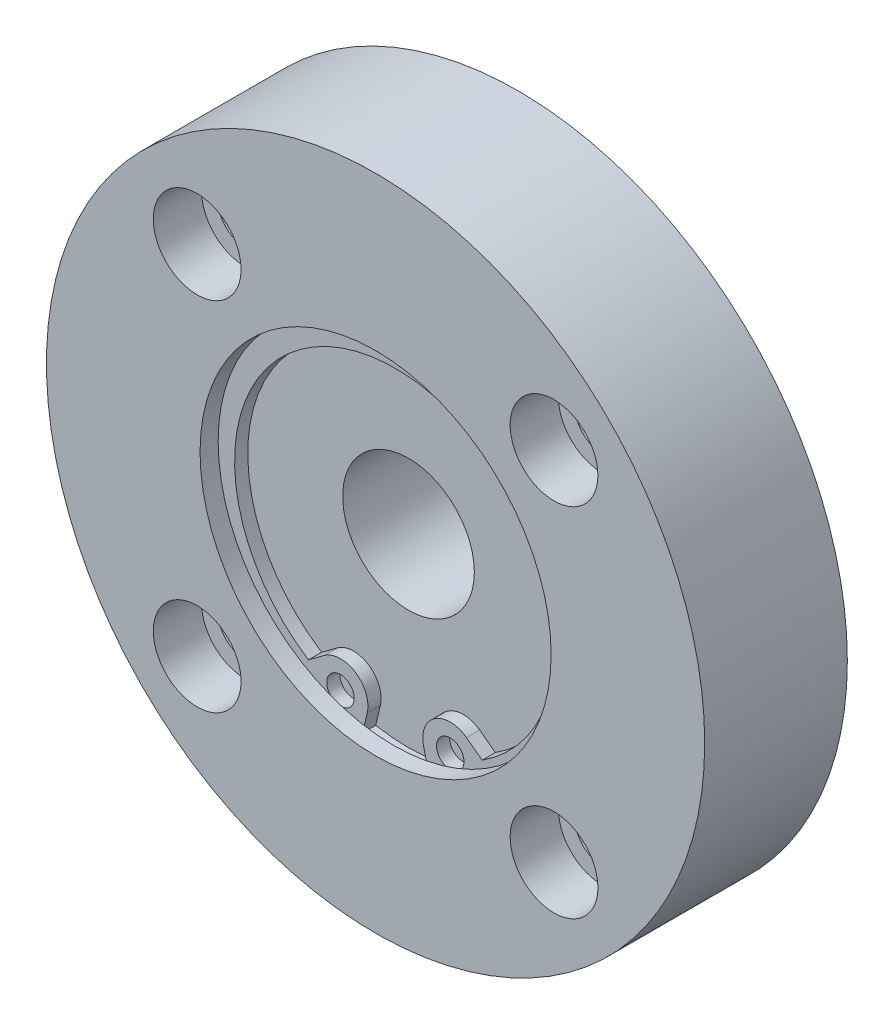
ISO-10303-21;
HEADER;
FILE_DESCRIPTION(('STEP AP214'),'2;1');
FILE_NAME('part.step','',(''),(''),'','','');
FILE_SCHEMA(('AUTOMOTIVE_DESIGN { 1 0 10303 214 1 1 1 1 }'));
ENDSEC;
DATA;
#1=APPLICATION_CONTEXT('core data for automotive mechanical design processes');
#2=APPLICATION_PROTOCOL_DEFINITION('international standard','automotive_design',2000,#1);
#3=PRODUCT_CONTEXT('',#1,'mechanical');
#4=PRODUCT('Part','Part','',(#3));
#5=PRODUCT_RELATED_PRODUCT_CATEGORY('part','',(#4));
#6=PRODUCT_DEFINITION_FORMATION('','',#4);
#7=PRODUCT_DEFINITION_CONTEXT('part definition',#1,'design');
#8=PRODUCT_DEFINITION('design','',#6,#7);
#9=PRODUCT_DEFINITION_SHAPE('','',#8);
#10=(LENGTH_UNIT() NAMED_UNIT(*) SI_UNIT(.MILLI.,.METRE.));
#11=(NAMED_UNIT(*) PLANE_ANGLE_UNIT() SI_UNIT($,.RADIAN.));
#12=(NAMED_UNIT(*) SI_UNIT($,.STERADIAN.) SOLID_ANGLE_UNIT());
#13=UNCERTAINTY_MEASURE_WITH_UNIT(LENGTH_MEASURE(1.E-05),#10,'distance_accuracy_value','');
#14=(GEOMETRIC_REPRESENTATION_CONTEXT(3) GLOBAL_UNCERTAINTY_ASSIGNED_CONTEXT((#13)) GLOBAL_UNIT_ASSIGNED_CONTEXT((#10,
#11,#12)) REPRESENTATION_CONTEXT('',''));
#15=CARTESIAN_POINT('',(0.,0.,0.));
#16=DIRECTION('',(0.,0.,1.));
#17=DIRECTION('',(1.,0.,0.));
#18=AXIS2_PLACEMENT_3D('',#15,#16,#17);
#19=CARTESIAN_POINT('',(0.,0.,10.));
#20=DIRECTION('',(0.,0.,1.));
#21=DIRECTION('',(1.,0.,0.));
#22=AXIS2_PLACEMENT_3D('',#19,#20,#21);
#23=PLANE('',#22);
#24=CARTESIAN_POINT('',(5.,-14.2233767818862,10.));
#25=DIRECTION('',(0.,0.,1.));
#26=DIRECTION('',(1.,0.,0.));
#27=AXIS2_PLACEMENT_3D('',#24,#25,#26);
#28=CIRCLE('',#27,1.25);
#29=CARTESIAN_POINT('',(6.25,-14.2233767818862,10.));
#30=VERTEX_POINT('',#29);
#31=EDGE_CURVE('E117',#30,#30,#28,.T.);
#32=ORIENTED_EDGE('',*,*,#31,.T.);
#33=EDGE_LOOP('',(#32));
#34=FACE_BOUND('',#33,.T.);
#35=ADVANCED_FACE('F14',(#34),#23,.T.);
#36=CARTESIAN_POINT('',(-5.,-14.2233767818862,10.));
#37=DIRECTION('',(0.,0.,-1.));
#38=DIRECTION('',(1.,0.,0.));
#39=AXIS2_PLACEMENT_3D('',#36,#37,#38);
#40=CIRCLE('',#39,1.25);
#41=CARTESIAN_POINT('',(-3.75,-14.2233767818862,10.));
#42=VERTEX_POINT('',#41);
#43=EDGE_CURVE('E143',#42,#42,#40,.T.);
#44=ORIENTED_EDGE('',*,*,#43,.F.);
#45=EDGE_LOOP('',(#44));
#46=FACE_BOUND('',#45,.T.);
#47=ADVANCED_FACE('F286',(#46),#23,.T.);
#48=CARTESIAN_POINT('',(16.2634559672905,16.2634559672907,0.));
#49=DIRECTION('',(0.,0.,1.));
#50=DIRECTION('',(1.,0.,0.));
#51=AXIS2_PLACEMENT_3D('',#48,#49,#50);
#52=CYLINDRICAL_SURFACE('',#51,2.5);
#53=CARTESIAN_POINT('',(16.2634559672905,16.2634559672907,0.));
#54=DIRECTION('',(0.,0.,1.));
#55=DIRECTION('',(1.,0.,0.));
#56=AXIS2_PLACEMENT_3D('',#53,#54,#55);
#57=CIRCLE('',#56,2.5);
#58=CARTESIAN_POINT('',(18.7634559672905,16.2634559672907,0.));
#59=VERTEX_POINT('',#58);
#60=EDGE_CURVE('E239',#59,#59,#57,.T.);
#61=ORIENTED_EDGE('',*,*,#60,.F.);
#62=EDGE_LOOP('',(#61));
#63=FACE_BOUND('',#62,.T.);
#64=CARTESIAN_POINT('',(16.2634559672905,16.2634559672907,8.6));
#65=DIRECTION('',(0.,0.,1.));
#66=DIRECTION('',(1.,0.,0.));
#67=AXIS2_PLACEMENT_3D('',#64,#65,#66);
#68=CIRCLE('',#67,2.5);
#69=CARTESIAN_POINT('',(18.7634559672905,16.2634559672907,8.6));
#70=VERTEX_POINT('',#69);
#71=EDGE_CURVE('E238',#70,#70,#68,.F.);
#72=ORIENTED_EDGE('',*,*,#71,.F.);
#73=EDGE_LOOP('',(#72));
#74=FACE_BOUND('',#73,.T.);
#75=ADVANCED_FACE('F294',(#63,#74),#52,.F.);
#76=CARTESIAN_POINT('',(16.2634559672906,-16.2634559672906,0.));
#77=DIRECTION('',(0.,0.,1.));
#78=DIRECTION('',(1.,0.,0.));
#79=AXIS2_PLACEMENT_3D('',#76,#77,#78);
#80=CYLINDRICAL_SURFACE('',#79,2.5);
#81=CARTESIAN_POINT('',(16.2634559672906,-16.2634559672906,0.));
#82=DIRECTION('',(0.,0.,1.));
#83=DIRECTION('',(0.,-1.,0.));
#84=AXIS2_PLACEMENT_3D('',#81,#82,#83);
#85=CIRCLE('',#84,2.5);
#86=CARTESIAN_POINT('',(16.2634559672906,-18.7634559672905,0.));
#87=VERTEX_POINT('',#86);
#88=EDGE_CURVE('E229',#87,#87,#85,.T.);
#89=ORIENTED_EDGE('',*,*,#88,.F.);
#90=EDGE_LOOP('',(#89));
#91=FACE_BOUND('',#90,.T.);
#92=CARTESIAN_POINT('',(16.2634559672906,-16.2634559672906,8.6));
#93=DIRECTION('',(0.,0.,1.));
#94=DIRECTION('',(1.,0.,0.));
#95=AXIS2_PLACEMENT_3D('',#92,#93,#94);
#96=CIRCLE('',#95,2.5);
#97=CARTESIAN_POINT('',(18.7634559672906,-16.2634559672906,8.6));
#98=VERTEX_POINT('',#97);
#99=EDGE_CURVE('E222',#98,#98,#96,.F.);
#100=ORIENTED_EDGE('',*,*,#99,.F.);
#101=EDGE_LOOP('',(#100));
#102=FACE_BOUND('',#101,.T.);
#103=ADVANCED_FACE('F608',(#91,#102),#80,.F.);
#104=CARTESIAN_POINT('',(-16.2634559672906,-16.2634559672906,0.));
#105=DIRECTION('',(0.,0.,1.));
#106=DIRECTION('',(1.,0.,0.));
#107=AXIS2_PLACEMENT_3D('',#104,#105,#106);
#108=CYLINDRICAL_SURFACE('',#107,2.5);
#109=CARTESIAN_POINT('',(-16.2634559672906,-16.2634559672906,0.));
#110=DIRECTION('',(0.,0.,1.));
#111=DIRECTION('',(-1.,0.,0.));
#112=AXIS2_PLACEMENT_3D('',#109,#110,#111);
#113=CIRCLE('',#112,2.5);
#114=CARTESIAN_POINT('',(-18.7634559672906,-16.2634559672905,0.));
#115=VERTEX_POINT('',#114);
#116=EDGE_CURVE('E226',#115,#115,#113,.T.);
#117=ORIENTED_EDGE('',*,*,#116,.F.);
#118=EDGE_LOOP('',(#117));
#119=FACE_BOUND('',#118,.T.);
#120=CARTESIAN_POINT('',(-16.2634559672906,-16.2634559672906,8.6));
#121=DIRECTION('',(0.,0.,1.));
#122=DIRECTION('',(1.,0.,0.));
#123=AXIS2_PLACEMENT_3D('',#120,#121,#122);
#124=CIRCLE('',#123,2.5);
#125=CARTESIAN_POINT('',(-13.7634559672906,-16.2634559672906,8.6));
#126=VERTEX_POINT('',#125);
#127=EDGE_CURVE('E215',#126,#126,#124,.F.);
#128=ORIENTED_EDGE('',*,*,#127,.F.);
#129=EDGE_LOOP('',(#128));
#130=FACE_BOUND('',#129,.T.);
#131=ADVANCED_FACE('F598',(#119,#130),#108,.F.);
#132=CARTESIAN_POINT('',(-16.2634559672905,16.2634559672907,0.));
#133=DIRECTION('',(0.,0.,1.));
#134=DIRECTION('',(1.,0.,0.));
#135=AXIS2_PLACEMENT_3D('',#132,#133,#134);
#136=CYLINDRICAL_SURFACE('',#135,2.5);
#137=CARTESIAN_POINT('',(-16.2634559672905,16.2634559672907,0.));
#138=DIRECTION('',(0.,0.,1.));
#139=DIRECTION('',(0.,1.,0.));
#140=AXIS2_PLACEMENT_3D('',#137,#138,#139);
#141=CIRCLE('',#140,2.5);
#142=CARTESIAN_POINT('',(-16.2634559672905,18.7634559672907,0.));
#143=VERTEX_POINT('',#142);
#144=EDGE_CURVE('E223',#143,#143,#141,.T.);
#145=ORIENTED_EDGE('',*,*,#144,.F.);
#146=EDGE_LOOP('',(#145));
#147=FACE_BOUND('',#146,.T.);
#148=CARTESIAN_POINT('',(-16.2634559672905,16.2634559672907,8.6));
#149=DIRECTION('',(0.,0.,1.));
#150=DIRECTION('',(1.,0.,0.));
#151=AXIS2_PLACEMENT_3D('',#148,#149,#150);
#152=CIRCLE('',#151,2.5);
#153=CARTESIAN_POINT('',(-13.7634559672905,16.2634559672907,8.6));
#154=VERTEX_POINT('',#153);
#155=EDGE_CURVE('E208',#154,#154,#152,.F.);
#156=ORIENTED_EDGE('',*,*,#155,.F.);
#157=EDGE_LOOP('',(#156));
#158=FACE_BOUND('',#157,.T.);
#159=ADVANCED_FACE('F589',(#147,#158),#136,.F.);
#160=CARTESIAN_POINT('',(0.,0.,0.));
#161=DIRECTION('',(0.,0.,1.));
#162=DIRECTION('',(1.,0.,0.));
#163=AXIS2_PLACEMENT_3D('',#160,#161,#162);
#164=PLANE('',#163);
#165=ORIENTED_EDGE('',*,*,#144,.T.);
#166=EDGE_LOOP('',(#165));
#167=FACE_BOUND('',#166,.T.);
#168=ORIENTED_EDGE('',*,*,#116,.T.);
#169=EDGE_LOOP('',(#168));
#170=FACE_BOUND('',#169,.T.);
#171=ORIENTED_EDGE('',*,*,#88,.T.);
#172=EDGE_LOOP('',(#171));
#173=FACE_BOUND('',#172,.T.);
#174=ORIENTED_EDGE('',*,*,#60,.T.);
#175=EDGE_LOOP('',(#174));
#176=FACE_BOUND('',#175,.T.);
#177=CARTESIAN_POINT('',(0.,0.,0.));
#178=DIRECTION('',(0.,0.,1.));
#179=DIRECTION('',(1.,0.,0.));
#180=AXIS2_PLACEMENT_3D('',#177,#178,#179);
#181=CIRCLE('',#180,30.);
#182=CARTESIAN_POINT('',(30.,0.,0.));
#183=VERTEX_POINT('',#182);
#184=EDGE_CURVE('E245',#183,#183,#181,.T.);
#185=ORIENTED_EDGE('',*,*,#184,.F.);
#186=EDGE_LOOP('',(#185));
#187=FACE_BOUND('',#186,.T.);
#188=CARTESIAN_POINT('',(0.,0.,0.));
#189=DIRECTION('',(0.,0.,-1.));
#190=DIRECTION('',(-1.,0.,0.));
#191=AXIS2_PLACEMENT_3D('',#188,#189,#190);
#192=CIRCLE('',#191,19.);
#193=CARTESIAN_POINT('',(-19.,0.,0.));
#194=VERTEX_POINT('',#193);
#195=EDGE_CURVE('E144',#194,#194,#192,.T.);
#196=ORIENTED_EDGE('',*,*,#195,.F.);
#197=EDGE_LOOP('',(#196));
#198=FACE_BOUND('',#197,.T.);
#199=ADVANCED_FACE('F282',(#167,#170,#173,#176,#187,#198),#164,.F.);
#200=CARTESIAN_POINT('',(16.2634559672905,16.2634559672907,8.6));
#201=DIRECTION('',(0.,0.,1.));
#202=DIRECTION('',(1.,0.,0.));
#203=AXIS2_PLACEMENT_3D('',#200,#201,#202);
#204=PLANE('',#203);
#205=CARTESIAN_POINT('',(16.2634559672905,16.2634559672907,8.6));
#206=DIRECTION('',(0.,0.,1.));
#207=DIRECTION('',(1.,0.,0.));
#208=AXIS2_PLACEMENT_3D('',#205,#206,#207);
#209=CIRCLE('',#208,4.);
#210=CARTESIAN_POINT('',(20.2634559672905,16.2634559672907,8.6));
#211=VERTEX_POINT('',#210);
#212=EDGE_CURVE('E235',#211,#211,#209,.T.);
#213=ORIENTED_EDGE('',*,*,#212,.T.);
#214=EDGE_LOOP('',(#213));
#215=FACE_BOUND('',#214,.T.);
#216=ORIENTED_EDGE('',*,*,#71,.T.);
#217=EDGE_LOOP('',(#216));
#218=FACE_BOUND('',#217,.T.);
#219=ADVANCED_FACE('F570',(#215,#218),#204,.T.);
#220=CARTESIAN_POINT('',(16.2634559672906,-16.2634559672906,8.6));
#221=DIRECTION('',(0.,0.,1.));
#222=DIRECTION('',(0.,-1.,0.));
#223=AXIS2_PLACEMENT_3D('',#220,#221,#222);
#224=PLANE('',#223);
#225=CARTESIAN_POINT('',(16.2634559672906,-16.2634559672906,8.6));
#226=DIRECTION('',(0.,0.,1.));
#227=DIRECTION('',(0.,-1.,0.));
#228=AXIS2_PLACEMENT_3D('',#225,#226,#227);
#229=CIRCLE('',#228,4.);
#230=CARTESIAN_POINT('',(16.2634559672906,-20.2634559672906,8.6));
#231=VERTEX_POINT('',#230);
#232=EDGE_CURVE('E219',#231,#231,#229,.T.);
#233=ORIENTED_EDGE('',*,*,#232,.T.);
#234=EDGE_LOOP('',(#233));
#235=FACE_BOUND('',#234,.T.);
#236=ORIENTED_EDGE('',*,*,#99,.T.);
#237=EDGE_LOOP('',(#236));
#238=FACE_BOUND('',#237,.T.);
#239=ADVANCED_FACE('F560',(#235,#238),#224,.T.);
#240=CARTESIAN_POINT('',(-16.2634559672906,-16.2634559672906,8.6));
#241=DIRECTION('',(0.,0.,1.));
#242=DIRECTION('',(-1.,0.,0.));
#243=AXIS2_PLACEMENT_3D('',#240,#241,#242);
#244=PLANE('',#243);
#245=CARTESIAN_POINT('',(-16.2634559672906,-16.2634559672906,8.6));
#246=DIRECTION('',(0.,0.,1.));
#247=DIRECTION('',(-1.,0.,0.));
#248=AXIS2_PLACEMENT_3D('',#245,#246,#247);
#249=CIRCLE('',#248,4.);
#250=CARTESIAN_POINT('',(-20.2634559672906,-16.2634559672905,8.6));
#251=VERTEX_POINT('',#250);
#252=EDGE_CURVE('E212',#251,#251,#249,.T.);
#253=ORIENTED_EDGE('',*,*,#252,.T.);
#254=EDGE_LOOP('',(#253));
#255=FACE_BOUND('',#254,.T.);
#256=ORIENTED_EDGE('',*,*,#127,.T.);
#257=EDGE_LOOP('',(#256));
#258=FACE_BOUND('',#257,.T.);
#259=ADVANCED_FACE('F550',(#255,#258),#244,.T.);
#260=CARTESIAN_POINT('',(-16.2634559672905,16.2634559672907,8.6));
#261=DIRECTION('',(0.,0.,1.));
#262=DIRECTION('',(0.,1.,0.));
#263=AXIS2_PLACEMENT_3D('',#260,#261,#262);
#264=PLANE('',#263);
#265=CARTESIAN_POINT('',(-16.2634559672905,16.2634559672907,8.6));
#266=DIRECTION('',(0.,0.,1.));
#267=DIRECTION('',(0.,1.,0.));
#268=AXIS2_PLACEMENT_3D('',#265,#266,#267);
#269=CIRCLE('',#268,4.);
#270=CARTESIAN_POINT('',(-16.2634559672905,20.2634559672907,8.6));
#271=VERTEX_POINT('',#270);
#272=EDGE_CURVE('E205',#271,#271,#269,.T.);
#273=ORIENTED_EDGE('',*,*,#272,.T.);
#274=EDGE_LOOP('',(#273));
#275=FACE_BOUND('',#274,.T.);
#276=ORIENTED_EDGE('',*,*,#155,.T.);
#277=EDGE_LOOP('',(#276));
#278=FACE_BOUND('',#277,.T.);
#279=ADVANCED_FACE('F541',(#275,#278),#264,.T.);
#280=CARTESIAN_POINT('',(0.,0.,-5.));
#281=DIRECTION('',(0.,0.,1.));
#282=DIRECTION('',(1.,0.,0.));
#283=AXIS2_PLACEMENT_3D('',#280,#281,#282);
#284=CYLINDRICAL_SURFACE('',#283,19.);
#285=CARTESIAN_POINT('',(0.,0.,-5.));
#286=DIRECTION('',(0.,0.,-1.));
#287=DIRECTION('',(-1.,0.,0.));
#288=AXIS2_PLACEMENT_3D('',#285,#286,#287);
#289=CIRCLE('',#288,19.);
#290=CARTESIAN_POINT('',(-19.,0.,-5.));
#291=VERTEX_POINT('',#290);
#292=EDGE_CURVE('E192',#291,#291,#289,.T.);
#293=ORIENTED_EDGE('',*,*,#292,.F.);
#294=EDGE_LOOP('',(#293));
#295=FACE_BOUND('',#294,.T.);
#296=ORIENTED_EDGE('',*,*,#195,.T.);
#297=EDGE_LOOP('',(#296));
#298=FACE_BOUND('',#297,.T.);
#299=ADVANCED_FACE('F532',(#295,#298),#284,.T.);
#300=CARTESIAN_POINT('',(0.,0.,13.));
#301=DIRECTION('',(0.,0.,-1.));
#302=DIRECTION('',(-1.,0.,0.));
#303=AXIS2_PLACEMENT_3D('',#300,#301,#302);
#304=CYLINDRICAL_SURFACE('',#303,30.);
#305=CARTESIAN_POINT('',(0.,0.,13.));
#306=DIRECTION('',(0.,0.,1.));
#307=DIRECTION('',(1.,0.,0.));
#308=AXIS2_PLACEMENT_3D('',#305,#306,#307);
#309=CIRCLE('',#308,30.);
#310=CARTESIAN_POINT('',(30.,0.,13.));
#311=VERTEX_POINT('',#310);
#312=EDGE_CURVE('E195',#311,#311,#309,.T.);
#313=ORIENTED_EDGE('',*,*,#312,.F.);
#314=EDGE_LOOP('',(#313));
#315=FACE_BOUND('',#314,.T.);
#316=ORIENTED_EDGE('',*,*,#184,.T.);
#317=EDGE_LOOP('',(#316));
#318=FACE_BOUND('',#317,.T.);
#319=ADVANCED_FACE('F16',(#315,#318),#304,.T.);
#320=CARTESIAN_POINT('',(16.2634559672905,16.2634559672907,8.6));
#321=DIRECTION('',(0.,0.,1.));
#322=DIRECTION('',(1.,0.,0.));
#323=AXIS2_PLACEMENT_3D('',#320,#321,#322);
#324=CYLINDRICAL_SURFACE('',#323,4.);
#325=ORIENTED_EDGE('',*,*,#212,.F.);
#326=EDGE_LOOP('',(#325));
#327=FACE_BOUND('',#326,.T.);
#328=CARTESIAN_POINT('',(16.2634559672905,16.2634559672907,13.));
#329=DIRECTION('',(0.,0.,1.));
#330=DIRECTION('',(1.,0.,0.));
#331=AXIS2_PLACEMENT_3D('',#328,#329,#330);
#332=CIRCLE('',#331,4.);
#333=CARTESIAN_POINT('',(20.2634559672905,16.2634559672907,13.));
#334=VERTEX_POINT('',#333);
#335=EDGE_CURVE('E232',#334,#334,#332,.T.);
#336=ORIENTED_EDGE('',*,*,#335,.T.);
#337=EDGE_LOOP('',(#336));
#338=FACE_BOUND('',#337,.T.);
#339=ADVANCED_FACE('F513',(#327,#338),#324,.F.);
#340=CARTESIAN_POINT('',(16.2634559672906,-16.2634559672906,8.6));
#341=DIRECTION('',(0.,0.,1.));
#342=DIRECTION('',(1.,0.,0.));
#343=AXIS2_PLACEMENT_3D('',#340,#341,#342);
#344=CYLINDRICAL_SURFACE('',#343,4.);
#345=ORIENTED_EDGE('',*,*,#232,.F.);
#346=EDGE_LOOP('',(#345));
#347=FACE_BOUND('',#346,.T.);
#348=CARTESIAN_POINT('',(16.2634559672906,-16.2634559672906,13.));
#349=DIRECTION('',(0.,0.,1.));
#350=DIRECTION('',(0.,-1.,0.));
#351=AXIS2_PLACEMENT_3D('',#348,#349,#350);
#352=CIRCLE('',#351,4.);
#353=CARTESIAN_POINT('',(16.2634559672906,-20.2634559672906,13.));
#354=VERTEX_POINT('',#353);
#355=EDGE_CURVE('E216',#354,#354,#352,.T.);
#356=ORIENTED_EDGE('',*,*,#355,.T.);
#357=EDGE_LOOP('',(#356));
#358=FACE_BOUND('',#357,.T.);
#359=ADVANCED_FACE('F503',(#347,#358),#344,.F.);
#360=CARTESIAN_POINT('',(-16.2634559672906,-16.2634559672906,8.6));
#361=DIRECTION('',(0.,0.,1.));
#362=DIRECTION('',(1.,0.,0.));
#363=AXIS2_PLACEMENT_3D('',#360,#361,#362);
#364=CYLINDRICAL_SURFACE('',#363,4.);
#365=ORIENTED_EDGE('',*,*,#252,.F.);
#366=EDGE_LOOP('',(#365));
#367=FACE_BOUND('',#366,.T.);
#368=CARTESIAN_POINT('',(-16.2634559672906,-16.2634559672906,13.));
#369=DIRECTION('',(0.,0.,1.));
#370=DIRECTION('',(-1.,0.,0.));
#371=AXIS2_PLACEMENT_3D('',#368,#369,#370);
#372=CIRCLE('',#371,4.);
#373=CARTESIAN_POINT('',(-20.2634559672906,-16.2634559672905,13.));
#374=VERTEX_POINT('',#373);
#375=EDGE_CURVE('E209',#374,#374,#372,.T.);
#376=ORIENTED_EDGE('',*,*,#375,.T.);
#377=EDGE_LOOP('',(#376));
#378=FACE_BOUND('',#377,.T.);
#379=ADVANCED_FACE('F493',(#367,#378),#364,.F.);
#380=CARTESIAN_POINT('',(-16.2634559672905,16.2634559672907,8.6));
#381=DIRECTION('',(0.,0.,1.));
#382=DIRECTION('',(1.,0.,0.));
#383=AXIS2_PLACEMENT_3D('',#380,#381,#382);
#384=CYLINDRICAL_SURFACE('',#383,4.);
#385=ORIENTED_EDGE('',*,*,#272,.F.);
#386=EDGE_LOOP('',(#385));
#387=FACE_BOUND('',#386,.T.);
#388=CARTESIAN_POINT('',(-16.2634559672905,16.2634559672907,13.));
#389=DIRECTION('',(0.,0.,1.));
#390=DIRECTION('',(0.,1.,0.));
#391=AXIS2_PLACEMENT_3D('',#388,#389,#390);
#392=CIRCLE('',#391,4.);
#393=CARTESIAN_POINT('',(-16.2634559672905,20.2634559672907,13.));
#394=VERTEX_POINT('',#393);
#395=EDGE_CURVE('E202',#394,#394,#392,.T.);
#396=ORIENTED_EDGE('',*,*,#395,.T.);
#397=EDGE_LOOP('',(#396));
#398=FACE_BOUND('',#397,.T.);
#399=ADVANCED_FACE('F483',(#387,#398),#384,.F.);
#400=CARTESIAN_POINT('',(0.,0.,-5.));
#401=DIRECTION('',(0.,0.,-1.));
#402=DIRECTION('',(-1.,0.,0.));
#403=AXIS2_PLACEMENT_3D('',#400,#401,#402);
#404=PLANE('',#403);
#405=ORIENTED_EDGE('',*,*,#292,.T.);
#406=EDGE_LOOP('',(#405));
#407=FACE_BOUND('',#406,.T.);
#408=CARTESIAN_POINT('',(0.,0.,-5.));
#409=DIRECTION('',(0.,0.,-1.));
#410=DIRECTION('',(-1.,0.,0.));
#411=AXIS2_PLACEMENT_3D('',#408,#409,#410);
#412=CIRCLE('',#411,13.);
#413=CARTESIAN_POINT('',(-13.,0.,-5.));
#414=VERTEX_POINT('',#413);
#415=EDGE_CURVE('E189',#414,#414,#412,.T.);
#416=ORIENTED_EDGE('',*,*,#415,.F.);
#417=EDGE_LOOP('',(#416));
#418=FACE_BOUND('',#417,.T.);
#419=ADVANCED_FACE('F474',(#407,#418),#404,.T.);
#420=CARTESIAN_POINT('',(0.,0.,13.));
#421=DIRECTION('',(0.,0.,1.));
#422=DIRECTION('',(1.,0.,0.));
#423=AXIS2_PLACEMENT_3D('',#420,#421,#422);
#424=PLANE('',#423);
#425=CARTESIAN_POINT('',(0.,0.,13.));
#426=DIRECTION('',(0.,0.,1.));
#427=DIRECTION('',(1.,0.,0.));
#428=AXIS2_PLACEMENT_3D('',#425,#426,#427);
#429=CIRCLE('',#428,16.);
#430=CARTESIAN_POINT('',(16.,0.,13.));
#431=VERTEX_POINT('',#430);
#432=EDGE_CURVE('E198',#431,#431,#429,.T.);
#433=ORIENTED_EDGE('',*,*,#432,.F.);
#434=EDGE_LOOP('',(#433));
#435=FACE_BOUND('',#434,.T.);
#436=ORIENTED_EDGE('',*,*,#395,.F.);
#437=EDGE_LOOP('',(#436));
#438=FACE_BOUND('',#437,.T.);
#439=ORIENTED_EDGE('',*,*,#375,.F.);
#440=EDGE_LOOP('',(#439));
#441=FACE_BOUND('',#440,.T.);
#442=ORIENTED_EDGE('',*,*,#355,.F.);
#443=EDGE_LOOP('',(#442));
#444=FACE_BOUND('',#443,.T.);
#445=ORIENTED_EDGE('',*,*,#335,.F.);
#446=EDGE_LOOP('',(#445));
#447=FACE_BOUND('',#446,.T.);
#448=ORIENTED_EDGE('',*,*,#312,.T.);
#449=EDGE_LOOP('',(#448));
#450=FACE_BOUND('',#449,.T.);
#451=ADVANCED_FACE('F464',(#435,#438,#441,#444,#447,#450),#424,.T.);
#452=CARTESIAN_POINT('',(0.,0.,-5.));
#453=DIRECTION('',(0.,0.,1.));
#454=DIRECTION('',(1.,0.,0.));
#455=AXIS2_PLACEMENT_3D('',#452,#453,#454);
#456=CYLINDRICAL_SURFACE('',#455,13.);
#457=ORIENTED_EDGE('',*,*,#415,.T.);
#458=EDGE_LOOP('',(#457));
#459=FACE_BOUND('',#458,.T.);
#460=CARTESIAN_POINT('',(0.,0.,0.));
#461=DIRECTION('',(0.,0.,-1.));
#462=DIRECTION('',(-1.,0.,0.));
#463=AXIS2_PLACEMENT_3D('',#460,#461,#462);
#464=CIRCLE('',#463,13.);
#465=CARTESIAN_POINT('',(-13.,0.,0.));
#466=VERTEX_POINT('',#465);
#467=EDGE_CURVE('E186',#466,#466,#464,.T.);
#468=ORIENTED_EDGE('',*,*,#467,.F.);
#469=EDGE_LOOP('',(#468));
#470=FACE_BOUND('',#469,.T.);
#471=ADVANCED_FACE('F456',(#459,#470),#456,.F.);
#472=CARTESIAN_POINT('',(0.,0.,10.));
#473=DIRECTION('',(0.,0.,1.));
#474=DIRECTION('',(1.,0.,0.));
#475=AXIS2_PLACEMENT_3D('',#472,#473,#474);
#476=CYLINDRICAL_SURFACE('',#475,16.);
#477=CARTESIAN_POINT('',(0.,0.,11.35));
#478=DIRECTION('',(0.,0.,1.));
#479=DIRECTION('',(1.,0.,0.));
#480=AXIS2_PLACEMENT_3D('',#477,#478,#479);
#481=CIRCLE('',#480,16.);
#482=CARTESIAN_POINT('',(16.,0.,11.35));
#483=VERTEX_POINT('',#482);
#484=EDGE_CURVE('E182',#483,#483,#481,.F.);
#485=ORIENTED_EDGE('',*,*,#484,.T.);
#486=EDGE_LOOP('',(#485));
#487=FACE_BOUND('',#486,.T.);
#488=ORIENTED_EDGE('',*,*,#432,.T.);
#489=EDGE_LOOP('',(#488));
#490=FACE_BOUND('',#489,.T.);
#491=ADVANCED_FACE('F263',(#487,#490),#476,.F.);
#492=ORIENTED_EDGE('',*,*,#467,.T.);
#493=EDGE_LOOP('',(#492));
#494=FACE_BOUND('',#493,.T.);
#495=CARTESIAN_POINT('',(0.,0.,0.));
#496=DIRECTION('',(0.,0.,1.));
#497=DIRECTION('',(1.,0.,0.));
#498=AXIS2_PLACEMENT_3D('',#495,#496,#497);
#499=CIRCLE('',#498,6.);
#500=CARTESIAN_POINT('',(6.,0.,0.));
#501=VERTEX_POINT('',#500);
#502=EDGE_CURVE('E242',#501,#501,#499,.T.);
#503=ORIENTED_EDGE('',*,*,#502,.T.);
#504=EDGE_LOOP('',(#503));
#505=FACE_BOUND('',#504,.T.);
#506=ADVANCED_FACE('F269',(#494,#505),#164,.F.);
#507=CARTESIAN_POINT('',(0.,0.,11.35));
#508=DIRECTION('',(0.,0.,1.));
#509=DIRECTION('',(1.,0.,0.));
#510=AXIS2_PLACEMENT_3D('',#507,#508,#509);
#511=PLANE('',#510);
#512=CARTESIAN_POINT('',(0.,0.,11.35));
#513=DIRECTION('',(0.,0.,1.));
#514=DIRECTION('',(1.,0.,0.));
#515=AXIS2_PLACEMENT_3D('',#512,#513,#514);
#516=CIRCLE('',#515,16.85);
#517=CARTESIAN_POINT('',(16.85,0.,11.35));
#518=VERTEX_POINT('',#517);
#519=EDGE_CURVE('E179',#518,#518,#516,.T.);
#520=ORIENTED_EDGE('',*,*,#519,.F.);
#521=EDGE_LOOP('',(#520));
#522=FACE_BOUND('',#521,.T.);
#523=ORIENTED_EDGE('',*,*,#484,.F.);
#524=EDGE_LOOP('',(#523));
#525=FACE_BOUND('',#524,.T.);
#526=ADVANCED_FACE('F266',(#522,#525),#511,.F.);
#527=CARTESIAN_POINT('',(0.,0.,11.35));
#528=DIRECTION('',(0.,0.,-1.));
#529=DIRECTION('',(-1.,0.,0.));
#530=AXIS2_PLACEMENT_3D('',#527,#528,#529);
#531=CYLINDRICAL_SURFACE('',#530,16.85);
#532=ORIENTED_EDGE('',*,*,#519,.T.);
#533=EDGE_LOOP('',(#532));
#534=FACE_BOUND('',#533,.T.);
#535=DIRECTION('',(0.,0.,-1.));
#536=VECTOR('',#535,1.);
#537=CARTESIAN_POINT('',(2.99125499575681,-16.5823669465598,11.35));
#538=LINE('',#537,#536);
#539=CARTESIAN_POINT('',(2.99125499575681,-16.5823669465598,10.));
#540=VERTEX_POINT('',#539);
#541=CARTESIAN_POINT('',(2.99125499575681,-16.5823669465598,11.2));
#542=VERTEX_POINT('',#541);
#543=EDGE_CURVE('E18',#540,#542,#538,.F.);
#544=ORIENTED_EDGE('',*,*,#543,.F.);
#545=CARTESIAN_POINT('',(0.,0.,10.));
#546=DIRECTION('',(0.,0.,1.));
#547=DIRECTION('',(1.,0.,0.));
#548=AXIS2_PLACEMENT_3D('',#545,#546,#547);
#549=CIRCLE('',#548,16.85);
#550=CARTESIAN_POINT('',(-2.99125499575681,-16.5823669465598,10.));
#551=VERTEX_POINT('',#550);
#552=EDGE_CURVE('E183',#551,#540,#549,.T.);
#553=ORIENTED_EDGE('',*,*,#552,.F.);
#554=DIRECTION('',(0.,0.,-1.));
#555=VECTOR('',#554,1.);
#556=CARTESIAN_POINT('',(-2.99125499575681,-16.5823669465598,11.35));
#557=LINE('',#556,#555);
#558=CARTESIAN_POINT('',(-2.99125499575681,-16.5823669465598,11.2));
#559=VERTEX_POINT('',#558);
#560=EDGE_CURVE('E176',#559,#551,#557,.T.);
#561=ORIENTED_EDGE('',*,*,#560,.F.);
#562=CARTESIAN_POINT('',(0.,0.,11.2));
#563=DIRECTION('',(0.,0.,-1.));
#564=DIRECTION('',(-1.,0.,0.));
#565=AXIS2_PLACEMENT_3D('',#562,#563,#564);
#566=CIRCLE('',#565,16.85);
#567=EDGE_CURVE('E9',#542,#559,#566,.F.);
#568=ORIENTED_EDGE('',*,*,#567,.F.);
#569=EDGE_LOOP('',(#544,#553,#561,#568));
#570=FACE_BOUND('',#569,.T.);
#571=ADVANCED_FACE('F268',(#534,#570),#531,.F.);
#572=CARTESIAN_POINT('',(0.,0.,13.));
#573=DIRECTION('',(0.,0.,-1.));
#574=DIRECTION('',(-1.,0.,0.));
#575=AXIS2_PLACEMENT_3D('',#572,#573,#574);
#576=CYLINDRICAL_SURFACE('',#575,6.);
#577=ORIENTED_EDGE('',*,*,#502,.F.);
#578=EDGE_LOOP('',(#577));
#579=FACE_BOUND('',#578,.T.);
#580=CARTESIAN_POINT('',(0.,0.,10.));
#581=DIRECTION('',(0.,0.,1.));
#582=DIRECTION('',(1.,0.,0.));
#583=AXIS2_PLACEMENT_3D('',#580,#581,#582);
#584=CIRCLE('',#583,6.);
#585=CARTESIAN_POINT('',(6.,0.,10.));
#586=VERTEX_POINT('',#585);
#587=EDGE_CURVE('E201',#586,#586,#584,.T.);
#588=ORIENTED_EDGE('',*,*,#587,.T.);
#589=EDGE_LOOP('',(#588));
#590=FACE_BOUND('',#589,.T.);
#591=ADVANCED_FACE('F277',(#579,#590),#576,.F.);
#592=ORIENTED_EDGE('',*,*,#587,.F.);
#593=EDGE_LOOP('',(#592));
#594=FACE_BOUND('',#593,.T.);
#595=DIRECTION('',(0.231349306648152,-0.972870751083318,0.));
#596=VECTOR('',#595,1.);
#597=CARTESIAN_POINT('',(2.5678231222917,-14.8017500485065,10.));
#598=LINE('',#597,#596);
#599=CARTESIAN_POINT('',(2.5678231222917,-14.8017500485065,10.));
#600=VERTEX_POINT('',#599);
#601=EDGE_CURVE('E34',#600,#540,#598,.T.);
#602=ORIENTED_EDGE('',*,*,#601,.F.);
#603=CARTESIAN_POINT('',(5.,-14.2233767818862,10.));
#604=DIRECTION('',(0.,0.,1.));
#605=DIRECTION('',(1.,0.,0.));
#606=AXIS2_PLACEMENT_3D('',#603,#604,#605);
#607=CIRCLE('',#606,2.5);
#608=CARTESIAN_POINT('',(6.49138441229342,-12.2169439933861,10.));
#609=VERTEX_POINT('',#608);
#610=EDGE_CURVE('E134',#609,#600,#607,.T.);
#611=ORIENTED_EDGE('',*,*,#610,.F.);
#612=DIRECTION('',(-0.802573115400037,0.596553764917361,0.));
#613=VECTOR('',#612,1.);
#614=CARTESIAN_POINT('',(6.49138441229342,-12.2169439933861,10.));
#615=LINE('',#614,#613);
#616=CARTESIAN_POINT('',(7.91695293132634,-13.2765711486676,10.));
#617=VERTEX_POINT('',#616);
#618=EDGE_CURVE('E148',#617,#609,#615,.T.);
#619=ORIENTED_EDGE('',*,*,#618,.F.);
#620=CARTESIAN_POINT('',(0.,-0.95,10.));
#621=DIRECTION('',(0.,0.,-1.));
#622=DIRECTION('',(0.,-1.,0.));
#623=AXIS2_PLACEMENT_3D('',#620,#621,#622);
#624=CIRCLE('',#623,14.65);
#625=CARTESIAN_POINT('',(-7.91695293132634,-13.2765711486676,10.));
#626=VERTEX_POINT('',#625);
#627=EDGE_CURVE('E163',#626,#617,#624,.T.);
#628=ORIENTED_EDGE('',*,*,#627,.F.);
#629=DIRECTION('',(-0.802573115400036,-0.596553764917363,0.));
#630=VECTOR('',#629,1.);
#631=CARTESIAN_POINT('',(-6.49138441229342,-12.2169439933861,10.));
#632=LINE('',#631,#630);
#633=CARTESIAN_POINT('',(-6.49138441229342,-12.2169439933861,10.));
#634=VERTEX_POINT('',#633);
#635=EDGE_CURVE('E116',#634,#626,#632,.T.);
#636=ORIENTED_EDGE('',*,*,#635,.F.);
#637=CARTESIAN_POINT('',(-5.,-14.2233767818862,10.));
#638=DIRECTION('',(0.,0.,1.));
#639=DIRECTION('',(-1.,0.,0.));
#640=AXIS2_PLACEMENT_3D('',#637,#638,#639);
#641=CIRCLE('',#640,2.5);
#642=CARTESIAN_POINT('',(-2.56782312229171,-14.8017500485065,10.));
#643=VERTEX_POINT('',#642);
#644=EDGE_CURVE('E113',#643,#634,#641,.T.);
#645=ORIENTED_EDGE('',*,*,#644,.F.);
#646=DIRECTION('',(0.231349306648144,0.97287075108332,0.));
#647=VECTOR('',#646,1.);
#648=CARTESIAN_POINT('',(-2.56782312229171,-14.8017500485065,10.));
#649=LINE('',#648,#647);
#650=EDGE_CURVE('E155',#551,#643,#649,.T.);
#651=ORIENTED_EDGE('',*,*,#650,.F.);
#652=ORIENTED_EDGE('',*,*,#552,.T.);
#653=EDGE_LOOP('',(#602,#611,#619,#628,#636,#645,#651,#652));
#654=FACE_BOUND('',#653,.T.);
#655=ADVANCED_FACE('F289',(#594,#654),#23,.T.);
#656=CARTESIAN_POINT('',(0.,-0.95,11.2));
#657=DIRECTION('',(0.,0.,1.));
#658=DIRECTION('',(-1.,0.,0.));
#659=AXIS2_PLACEMENT_3D('',#656,#657,#658);
#660=CYLINDRICAL_SURFACE('',#659,14.65);
#661=ORIENTED_EDGE('',*,*,#627,.T.);
#662=DIRECTION('',(0.,0.,-1.));
#663=VECTOR('',#662,1.);
#664=CARTESIAN_POINT('',(7.91695293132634,-13.2765711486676,11.2));
#665=LINE('',#664,#663);
#666=CARTESIAN_POINT('',(7.91695293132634,-13.2765711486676,11.2));
#667=VERTEX_POINT('',#666);
#668=EDGE_CURVE('E103',#667,#617,#665,.T.);
#669=ORIENTED_EDGE('',*,*,#668,.F.);
#670=CARTESIAN_POINT('',(0.,-0.95,11.2));
#671=DIRECTION('',(0.,0.,-1.));
#672=DIRECTION('',(0.,-1.,0.));
#673=AXIS2_PLACEMENT_3D('',#670,#671,#672);
#674=CIRCLE('',#673,14.65);
#675=CARTESIAN_POINT('',(-7.91695293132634,-13.2765711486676,11.2));
#676=VERTEX_POINT('',#675);
#677=EDGE_CURVE('E104',#676,#667,#674,.T.);
#678=ORIENTED_EDGE('',*,*,#677,.F.);
#679=DIRECTION('',(0.,0.,-1.));
#680=VECTOR('',#679,1.);
#681=CARTESIAN_POINT('',(-7.91695293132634,-13.2765711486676,11.2));
#682=LINE('',#681,#680);
#683=EDGE_CURVE('E98',#676,#626,#682,.T.);
#684=ORIENTED_EDGE('',*,*,#683,.T.);
#685=EDGE_LOOP('',(#661,#669,#678,#684));
#686=FACE_BOUND('',#685,.T.);
#687=ADVANCED_FACE('F290',(#686),#660,.F.);
#688=CARTESIAN_POINT('',(6.49138441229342,-12.2169439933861,11.2));
#689=DIRECTION('',(-0.596553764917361,-0.802573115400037,0.));
#690=DIRECTION('',(-0.802573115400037,0.596553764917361,0.));
#691=AXIS2_PLACEMENT_3D('',#688,#689,#690);
#692=PLANE('',#691);
#693=ORIENTED_EDGE('',*,*,#618,.T.);
#694=DIRECTION('',(0.,0.,-1.));
#695=VECTOR('',#694,1.);
#696=CARTESIAN_POINT('',(6.49138441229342,-12.2169439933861,11.2));
#697=LINE('',#696,#695);
#698=CARTESIAN_POINT('',(6.49138441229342,-12.2169439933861,11.2));
#699=VERTEX_POINT('',#698);
#700=EDGE_CURVE('E153',#699,#609,#697,.T.);
#701=ORIENTED_EDGE('',*,*,#700,.F.);
#702=DIRECTION('',(-0.802573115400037,0.596553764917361,0.));
#703=VECTOR('',#702,1.);
#704=CARTESIAN_POINT('',(6.49138441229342,-12.2169439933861,11.2));
#705=LINE('',#704,#703);
#706=EDGE_CURVE('E138',#667,#699,#705,.T.);
#707=ORIENTED_EDGE('',*,*,#706,.F.);
#708=ORIENTED_EDGE('',*,*,#668,.T.);
#709=EDGE_LOOP('',(#693,#701,#707,#708));
#710=FACE_BOUND('',#709,.T.);
#711=ADVANCED_FACE('F302',(#710),#692,.F.);
#712=CARTESIAN_POINT('',(5.,-14.2233767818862,11.2));
#713=DIRECTION('',(0.,0.,1.));
#714=DIRECTION('',(-1.,0.,0.));
#715=AXIS2_PLACEMENT_3D('',#712,#713,#714);
#716=CYLINDRICAL_SURFACE('',#715,2.5);
#717=ORIENTED_EDGE('',*,*,#610,.T.);
#718=DIRECTION('',(0.,0.,-1.));
#719=VECTOR('',#718,1.);
#720=CARTESIAN_POINT('',(2.5678231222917,-14.8017500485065,11.2));
#721=LINE('',#720,#719);
#722=CARTESIAN_POINT('',(2.5678231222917,-14.8017500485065,11.2));
#723=VERTEX_POINT('',#722);
#724=EDGE_CURVE('E154',#723,#600,#721,.T.);
#725=ORIENTED_EDGE('',*,*,#724,.F.);
#726=CARTESIAN_POINT('',(5.,-14.2233767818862,11.2));
#727=DIRECTION('',(0.,0.,1.));
#728=DIRECTION('',(1.,0.,0.));
#729=AXIS2_PLACEMENT_3D('',#726,#727,#728);
#730=CIRCLE('',#729,2.5);
#731=EDGE_CURVE('E167',#699,#723,#730,.T.);
#732=ORIENTED_EDGE('',*,*,#731,.F.);
#733=ORIENTED_EDGE('',*,*,#700,.T.);
#734=EDGE_LOOP('',(#717,#725,#732,#733));
#735=FACE_BOUND('',#734,.T.);
#736=ADVANCED_FACE('F308',(#735),#716,.T.);
#737=CARTESIAN_POINT('',(-2.56782312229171,-14.8017500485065,11.2));
#738=DIRECTION('',(-0.97287075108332,0.231349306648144,0.));
#739=DIRECTION('',(0.,0.,1.));
#740=AXIS2_PLACEMENT_3D('',#737,#738,#739);
#741=PLANE('',#740);
#742=DIRECTION('',(0.231349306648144,0.97287075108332,0.));
#743=VECTOR('',#742,1.);
#744=CARTESIAN_POINT('',(-2.56782312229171,-14.8017500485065,11.2));
#745=LINE('',#744,#743);
#746=CARTESIAN_POINT('',(-2.56782312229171,-14.8017500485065,11.2));
#747=VERTEX_POINT('',#746);
#748=EDGE_CURVE('E122',#559,#747,#745,.T.);
#749=ORIENTED_EDGE('',*,*,#748,.F.);
#750=ORIENTED_EDGE('',*,*,#560,.T.);
#751=ORIENTED_EDGE('',*,*,#650,.T.);
#752=DIRECTION('',(0.,0.,-1.));
#753=VECTOR('',#752,1.);
#754=CARTESIAN_POINT('',(-2.56782312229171,-14.8017500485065,11.2));
#755=LINE('',#754,#753);
#756=EDGE_CURVE('E172',#747,#643,#755,.T.);
#757=ORIENTED_EDGE('',*,*,#756,.F.);
#758=EDGE_LOOP('',(#749,#750,#751,#757));
#759=FACE_BOUND('',#758,.T.);
#760=ADVANCED_FACE('F314',(#759),#741,.F.);
#761=CARTESIAN_POINT('',(0.,-0.95,11.2));
#762=DIRECTION('',(0.,0.,-1.));
#763=DIRECTION('',(0.,-1.,0.));
#764=AXIS2_PLACEMENT_3D('',#761,#762,#763);
#765=PLANE('',#764);
#766=CARTESIAN_POINT('',(-5.,-14.2233767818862,11.2));
#767=DIRECTION('',(0.,0.,-1.));
#768=DIRECTION('',(1.,0.,0.));
#769=AXIS2_PLACEMENT_3D('',#766,#767,#768);
#770=CIRCLE('',#769,1.25);
#771=CARTESIAN_POINT('',(-3.75,-14.2233767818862,11.2));
#772=VERTEX_POINT('',#771);
#773=EDGE_CURVE('E124',#772,#772,#770,.T.);
#774=ORIENTED_EDGE('',*,*,#773,.T.);
#775=EDGE_LOOP('',(#774));
#776=FACE_BOUND('',#775,.T.);
#777=CARTESIAN_POINT('',(5.,-14.2233767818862,11.2));
#778=DIRECTION('',(0.,0.,1.));
#779=DIRECTION('',(1.,0.,0.));
#780=AXIS2_PLACEMENT_3D('',#777,#778,#779);
#781=CIRCLE('',#780,1.25);
#782=CARTESIAN_POINT('',(6.25,-14.2233767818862,11.2));
#783=VERTEX_POINT('',#782);
#784=EDGE_CURVE('E140',#783,#783,#781,.T.);
#785=ORIENTED_EDGE('',*,*,#784,.F.);
#786=EDGE_LOOP('',(#785));
#787=FACE_BOUND('',#786,.T.);
#788=DIRECTION('',(0.231349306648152,-0.972870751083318,0.));
#789=VECTOR('',#788,1.);
#790=CARTESIAN_POINT('',(2.5678231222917,-14.8017500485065,11.2));
#791=LINE('',#790,#789);
#792=EDGE_CURVE('E130',#723,#542,#791,.T.);
#793=ORIENTED_EDGE('',*,*,#792,.T.);
#794=ORIENTED_EDGE('',*,*,#567,.T.);
#795=ORIENTED_EDGE('',*,*,#748,.T.);
#796=CARTESIAN_POINT('',(-5.,-14.2233767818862,11.2));
#797=DIRECTION('',(0.,0.,1.));
#798=DIRECTION('',(-1.,0.,0.));
#799=AXIS2_PLACEMENT_3D('',#796,#797,#798);
#800=CIRCLE('',#799,2.5);
#801=CARTESIAN_POINT('',(-6.49138441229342,-12.2169439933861,11.2));
#802=VERTEX_POINT('',#801);
#803=EDGE_CURVE('E110',#747,#802,#800,.T.);
#804=ORIENTED_EDGE('',*,*,#803,.T.);
#805=DIRECTION('',(-0.802573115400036,-0.596553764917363,0.));
#806=VECTOR('',#805,1.);
#807=CARTESIAN_POINT('',(-6.49138441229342,-12.2169439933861,11.2));
#808=LINE('',#807,#806);
#809=EDGE_CURVE('E93',#802,#676,#808,.T.);
#810=ORIENTED_EDGE('',*,*,#809,.T.);
#811=ORIENTED_EDGE('',*,*,#677,.T.);
#812=ORIENTED_EDGE('',*,*,#706,.T.);
#813=ORIENTED_EDGE('',*,*,#731,.T.);
#814=EDGE_LOOP('',(#793,#794,#795,#804,#810,#811,#812,#813));
#815=FACE_BOUND('',#814,.T.);
#816=ADVANCED_FACE('F120',(#776,#787,#815),#765,.F.);
#817=CARTESIAN_POINT('',(5.,-14.2233767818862,11.2));
#818=DIRECTION('',(0.,0.,1.));
#819=DIRECTION('',(-1.,0.,0.));
#820=AXIS2_PLACEMENT_3D('',#817,#818,#819);
#821=CYLINDRICAL_SURFACE('',#820,1.25);
#822=ORIENTED_EDGE('',*,*,#31,.F.);
#823=EDGE_LOOP('',(#822));
#824=FACE_BOUND('',#823,.T.);
#825=ORIENTED_EDGE('',*,*,#784,.T.);
#826=EDGE_LOOP('',(#825));
#827=FACE_BOUND('',#826,.T.);
#828=ADVANCED_FACE('F367',(#824,#827),#821,.F.);
#829=CARTESIAN_POINT('',(-5.,-14.2233767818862,11.2));
#830=DIRECTION('',(0.,0.,1.));
#831=DIRECTION('',(-1.,0.,0.));
#832=AXIS2_PLACEMENT_3D('',#829,#830,#831);
#833=CYLINDRICAL_SURFACE('',#832,1.25);
#834=ORIENTED_EDGE('',*,*,#43,.T.);
#835=EDGE_LOOP('',(#834));
#836=FACE_BOUND('',#835,.T.);
#837=ORIENTED_EDGE('',*,*,#773,.F.);
#838=EDGE_LOOP('',(#837));
#839=FACE_BOUND('',#838,.T.);
#840=ADVANCED_FACE('F364',(#836,#839),#833,.F.);
#841=CARTESIAN_POINT('',(-6.49138441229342,-12.2169439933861,11.2));
#842=DIRECTION('',(0.596553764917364,-0.802573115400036,0.));
#843=DIRECTION('',(0.,0.,-1.));
#844=AXIS2_PLACEMENT_3D('',#841,#842,#843);
#845=PLANE('',#844);
#846=ORIENTED_EDGE('',*,*,#635,.T.);
#847=ORIENTED_EDGE('',*,*,#683,.F.);
#848=ORIENTED_EDGE('',*,*,#809,.F.);
#849=DIRECTION('',(0.,0.,-1.));
#850=VECTOR('',#849,1.);
#851=CARTESIAN_POINT('',(-6.49138441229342,-12.2169439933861,11.2));
#852=LINE('',#851,#850);
#853=EDGE_CURVE('E96',#802,#634,#852,.T.);
#854=ORIENTED_EDGE('',*,*,#853,.T.);
#855=EDGE_LOOP('',(#846,#847,#848,#854));
#856=FACE_BOUND('',#855,.T.);
#857=ADVANCED_FACE('F95',(#856),#845,.F.);
#858=CARTESIAN_POINT('',(-5.,-14.2233767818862,11.2));
#859=DIRECTION('',(0.,0.,1.));
#860=DIRECTION('',(-1.,0.,0.));
#861=AXIS2_PLACEMENT_3D('',#858,#859,#860);
#862=CYLINDRICAL_SURFACE('',#861,2.5);
#863=ORIENTED_EDGE('',*,*,#644,.T.);
#864=ORIENTED_EDGE('',*,*,#853,.F.);
#865=ORIENTED_EDGE('',*,*,#803,.F.);
#866=ORIENTED_EDGE('',*,*,#756,.T.);
#867=EDGE_LOOP('',(#863,#864,#865,#866));
#868=FACE_BOUND('',#867,.T.);
#869=ADVANCED_FACE('F108',(#868),#862,.T.);
#870=CARTESIAN_POINT('',(2.5678231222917,-14.8017500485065,11.2));
#871=DIRECTION('',(0.972870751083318,0.231349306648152,0.));
#872=DIRECTION('',(0.,0.,-1.));
#873=AXIS2_PLACEMENT_3D('',#870,#871,#872);
#874=PLANE('',#873);
#875=ORIENTED_EDGE('',*,*,#601,.T.);
#876=ORIENTED_EDGE('',*,*,#543,.T.);
#877=ORIENTED_EDGE('',*,*,#792,.F.);
#878=ORIENTED_EDGE('',*,*,#724,.T.);
#879=EDGE_LOOP('',(#875,#876,#877,#878));
#880=FACE_BOUND('',#879,.T.);
#881=ADVANCED_FACE('F296',(#880),#874,.F.);
#882=CLOSED_SHELL('',(#35,#47,#75,#103,#131,#159,#199,#219,#239,#259,#279,#299,#319,#339,#359,
#379,#399,#419,#451,#471,#491,#506,#526,#571,#591,#655,#687,#711,#736,#760,#816,#828,#840,#857,
#869,#881));
#883=MANIFOLD_SOLID_BREP('B1',#882);
#884=ADVANCED_BREP_SHAPE_REPRESENTATION('',(#18,#883),#14);
#885=SHAPE_DEFINITION_REPRESENTATION(#9,#884);
ENDSEC;
END-ISO-10303-21;
